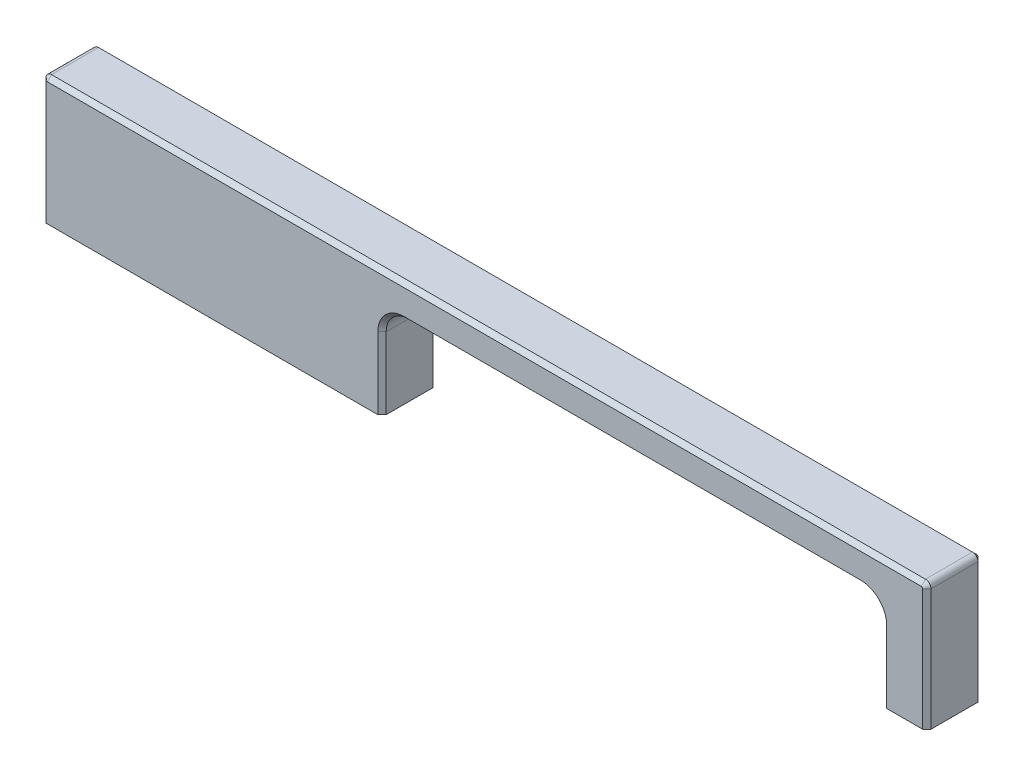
ISO-10303-21;
HEADER;
FILE_DESCRIPTION(('STEP AP214'),'2;1');
FILE_NAME('part.step','',(''),(''),'','','');
FILE_SCHEMA(('AUTOMOTIVE_DESIGN { 1 0 10303 214 1 1 1 1 }'));
ENDSEC;
DATA;
#1=APPLICATION_CONTEXT('core data for automotive mechanical design processes');
#2=APPLICATION_PROTOCOL_DEFINITION('international standard','automotive_design',2000,#1);
#3=PRODUCT_CONTEXT('',#1,'mechanical');
#4=PRODUCT('Part','Part','',(#3));
#5=PRODUCT_RELATED_PRODUCT_CATEGORY('part','',(#4));
#6=PRODUCT_DEFINITION_FORMATION('','',#4);
#7=PRODUCT_DEFINITION_CONTEXT('part definition',#1,'design');
#8=PRODUCT_DEFINITION('design','',#6,#7);
#9=PRODUCT_DEFINITION_SHAPE('','',#8);
#10=(LENGTH_UNIT() NAMED_UNIT(*) SI_UNIT(.MILLI.,.METRE.));
#11=(NAMED_UNIT(*) PLANE_ANGLE_UNIT() SI_UNIT($,.RADIAN.));
#12=(NAMED_UNIT(*) SI_UNIT($,.STERADIAN.) SOLID_ANGLE_UNIT());
#13=UNCERTAINTY_MEASURE_WITH_UNIT(LENGTH_MEASURE(1.E-05),#10,'distance_accuracy_value','');
#14=(GEOMETRIC_REPRESENTATION_CONTEXT(3) GLOBAL_UNCERTAINTY_ASSIGNED_CONTEXT((#13)) GLOBAL_UNIT_ASSIGNED_CONTEXT((#10,
#11,#12)) REPRESENTATION_CONTEXT('',''));
#15=CARTESIAN_POINT('',(0.,0.,0.));
#16=DIRECTION('',(0.,0.,1.));
#17=DIRECTION('',(1.,0.,0.));
#18=AXIS2_PLACEMENT_3D('',#15,#16,#17);
#19=CARTESIAN_POINT('',(80.,23.,5.));
#20=DIRECTION('',(-1.,0.,0.));
#21=DIRECTION('',(0.,-1.,0.));
#22=AXIS2_PLACEMENT_3D('',#19,#20,#21);
#23=PLANE('',#22);
#24=DIRECTION('',(0.,0.,-1.));
#25=VECTOR('',#24,1.);
#26=CARTESIAN_POINT('',(80.,0.,5.));
#27=LINE('',#26,#25);
#28=CARTESIAN_POINT('',(80.,0.,4.25));
#29=VERTEX_POINT('',#28);
#30=CARTESIAN_POINT('',(80.,0.,-4.25000000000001));
#31=VERTEX_POINT('',#30);
#32=EDGE_CURVE('E248',#29,#31,#27,.T.);
#33=ORIENTED_EDGE('',*,*,#32,.T.);
#34=DIRECTION('',(0.,1.,0.));
#35=VECTOR('',#34,1.);
#36=CARTESIAN_POINT('',(80.,22.,-4.25000000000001));
#37=LINE('',#36,#35);
#38=CARTESIAN_POINT('',(80.,22.,-4.25000000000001));
#39=VERTEX_POINT('',#38);
#40=EDGE_CURVE('E390',#31,#39,#37,.T.);
#41=ORIENTED_EDGE('',*,*,#40,.T.);
#42=DIRECTION('',(0.,0.,-1.));
#43=VECTOR('',#42,1.);
#44=CARTESIAN_POINT('',(80.,22.,5.));
#45=LINE('',#44,#43);
#46=CARTESIAN_POINT('',(80.,22.,4.25));
#47=VERTEX_POINT('',#46);
#48=EDGE_CURVE('E294',#39,#47,#45,.F.);
#49=ORIENTED_EDGE('',*,*,#48,.T.);
#50=DIRECTION('',(0.,-1.,0.));
#51=VECTOR('',#50,1.);
#52=CARTESIAN_POINT('',(80.,23.,4.25));
#53=LINE('',#52,#51);
#54=EDGE_CURVE('E387',#47,#29,#53,.T.);
#55=ORIENTED_EDGE('',*,*,#54,.T.);
#56=EDGE_LOOP('',(#33,#41,#49,#55));
#57=FACE_BOUND('',#56,.T.);
#58=ADVANCED_FACE('F45',(#57),#23,.F.);
#59=CARTESIAN_POINT('',(-80.,23.,5.));
#60=DIRECTION('',(0.,-1.,0.));
#61=DIRECTION('',(0.,0.,-1.));
#62=AXIS2_PLACEMENT_3D('',#59,#60,#61);
#63=PLANE('',#62);
#64=DIRECTION('',(0.,0.,-1.));
#65=VECTOR('',#64,1.);
#66=CARTESIAN_POINT('',(79.,23.,5.));
#67=LINE('',#66,#65);
#68=CARTESIAN_POINT('',(79.,23.,4.25));
#69=VERTEX_POINT('',#68);
#70=CARTESIAN_POINT('',(79.,23.,-4.25000000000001));
#71=VERTEX_POINT('',#70);
#72=EDGE_CURVE('E290',#69,#71,#67,.T.);
#73=ORIENTED_EDGE('',*,*,#72,.T.);
#74=DIRECTION('',(-1.,0.,0.));
#75=VECTOR('',#74,1.);
#76=CARTESIAN_POINT('',(-79.,23.,-4.25000000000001));
#77=LINE('',#76,#75);
#78=CARTESIAN_POINT('',(-79.,23.,-4.25000000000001));
#79=VERTEX_POINT('',#78);
#80=EDGE_CURVE('E403',#71,#79,#77,.T.);
#81=ORIENTED_EDGE('',*,*,#80,.T.);
#82=DIRECTION('',(0.,0.,-1.));
#83=VECTOR('',#82,1.);
#84=CARTESIAN_POINT('',(-79.,23.,5.));
#85=LINE('',#84,#83);
#86=CARTESIAN_POINT('',(-79.,23.,4.25));
#87=VERTEX_POINT('',#86);
#88=EDGE_CURVE('E286',#79,#87,#85,.F.);
#89=ORIENTED_EDGE('',*,*,#88,.T.);
#90=DIRECTION('',(1.,0.,0.));
#91=VECTOR('',#90,1.);
#92=CARTESIAN_POINT('',(-80.,23.,4.25));
#93=LINE('',#92,#91);
#94=EDGE_CURVE('E400',#87,#69,#93,.T.);
#95=ORIENTED_EDGE('',*,*,#94,.T.);
#96=EDGE_LOOP('',(#73,#81,#89,#95));
#97=FACE_BOUND('',#96,.T.);
#98=ADVANCED_FACE('F576',(#97),#63,.F.);
#99=CARTESIAN_POINT('',(-80.,0.,5.));
#100=DIRECTION('',(1.,0.,0.));
#101=DIRECTION('',(0.,1.,0.));
#102=AXIS2_PLACEMENT_3D('',#99,#100,#101);
#103=PLANE('',#102);
#104=DIRECTION('',(0.,0.,-1.));
#105=VECTOR('',#104,1.);
#106=CARTESIAN_POINT('',(-80.,22.,5.));
#107=LINE('',#106,#105);
#108=CARTESIAN_POINT('',(-80.,22.,4.25));
#109=VERTEX_POINT('',#108);
#110=CARTESIAN_POINT('',(-80.,22.,-4.25000000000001));
#111=VERTEX_POINT('',#110);
#112=EDGE_CURVE('E298',#109,#111,#107,.T.);
#113=ORIENTED_EDGE('',*,*,#112,.T.);
#114=DIRECTION('',(0.,-1.,0.));
#115=VECTOR('',#114,1.);
#116=CARTESIAN_POINT('',(-80.,0.,-4.25000000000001));
#117=LINE('',#116,#115);
#118=CARTESIAN_POINT('',(-80.,0.,-4.25000000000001));
#119=VERTEX_POINT('',#118);
#120=EDGE_CURVE('E415',#111,#119,#117,.T.);
#121=ORIENTED_EDGE('',*,*,#120,.T.);
#122=DIRECTION('',(0.,0.,-1.));
#123=VECTOR('',#122,1.);
#124=CARTESIAN_POINT('',(-80.,0.,5.));
#125=LINE('',#124,#123);
#126=CARTESIAN_POINT('',(-80.,0.,4.25));
#127=VERTEX_POINT('',#126);
#128=EDGE_CURVE('E266',#127,#119,#125,.T.);
#129=ORIENTED_EDGE('',*,*,#128,.F.);
#130=DIRECTION('',(0.,1.,0.));
#131=VECTOR('',#130,1.);
#132=CARTESIAN_POINT('',(-80.,0.,4.25));
#133=LINE('',#132,#131);
#134=EDGE_CURVE('E412',#127,#109,#133,.T.);
#135=ORIENTED_EDGE('',*,*,#134,.T.);
#136=EDGE_LOOP('',(#113,#121,#129,#135));
#137=FACE_BOUND('',#136,.T.);
#138=ADVANCED_FACE('F592',(#137),#103,.F.);
#139=CARTESIAN_POINT('',(-18.5,0.,5.));
#140=DIRECTION('',(0.,1.,0.));
#141=DIRECTION('',(-1.,0.,0.));
#142=AXIS2_PLACEMENT_3D('',#139,#140,#141);
#143=PLANE('',#142);
#144=CARTESIAN_POINT('',(-54.,0.,0.));
#145=DIRECTION('',(0.,-1.,0.));
#146=DIRECTION('',(0.,0.,-1.));
#147=AXIS2_PLACEMENT_3D('',#144,#145,#146);
#148=CIRCLE('',#147,1.64999999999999);
#149=CARTESIAN_POINT('',(-54.,0.,-1.65));
#150=VERTEX_POINT('',#149);
#151=EDGE_CURVE('E223',#150,#150,#148,.T.);
#152=ORIENTED_EDGE('',*,*,#151,.F.);
#153=EDGE_LOOP('',(#152));
#154=FACE_BOUND('',#153,.T.);
#155=DIRECTION('',(1.,0.,0.));
#156=VECTOR('',#155,1.);
#157=CARTESIAN_POINT('',(-18.5,0.,-5.));
#158=LINE('',#157,#156);
#159=CARTESIAN_POINT('',(-79.25,0.,-5.));
#160=VERTEX_POINT('',#159);
#161=CARTESIAN_POINT('',(-19.25,0.,-5.));
#162=VERTEX_POINT('',#161);
#163=EDGE_CURVE('E238',#160,#162,#158,.T.);
#164=ORIENTED_EDGE('',*,*,#163,.T.);
#165=DIRECTION('',(0.707106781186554,0.,0.707106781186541));
#166=VECTOR('',#165,1.);
#167=CARTESIAN_POINT('',(-18.5,0.,-4.25000000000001));
#168=LINE('',#167,#166);
#169=CARTESIAN_POINT('',(-18.5,0.,-4.25000000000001));
#170=VERTEX_POINT('',#169);
#171=EDGE_CURVE('E384',#162,#170,#168,.T.);
#172=ORIENTED_EDGE('',*,*,#171,.T.);
#173=DIRECTION('',(0.,0.,-1.));
#174=VECTOR('',#173,1.);
#175=CARTESIAN_POINT('',(-18.5,0.,5.));
#176=LINE('',#175,#174);
#177=CARTESIAN_POINT('',(-18.5,0.,4.25));
#178=VERTEX_POINT('',#177);
#179=EDGE_CURVE('E262',#178,#170,#176,.T.);
#180=ORIENTED_EDGE('',*,*,#179,.F.);
#181=DIRECTION('',(0.707106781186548,0.,-0.707106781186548));
#182=VECTOR('',#181,1.);
#183=CARTESIAN_POINT('',(-19.25,0.,5.));
#184=LINE('',#183,#182);
#185=CARTESIAN_POINT('',(-19.25,0.,5.));
#186=VERTEX_POINT('',#185);
#187=EDGE_CURVE('E378',#178,#186,#184,.F.);
#188=ORIENTED_EDGE('',*,*,#187,.T.);
#189=DIRECTION('',(1.,0.,0.));
#190=VECTOR('',#189,1.);
#191=CARTESIAN_POINT('',(-18.5,0.,5.));
#192=LINE('',#191,#190);
#193=CARTESIAN_POINT('',(-79.25,0.,5.));
#194=VERTEX_POINT('',#193);
#195=EDGE_CURVE('E239',#194,#186,#192,.T.);
#196=ORIENTED_EDGE('',*,*,#195,.F.);
#197=DIRECTION('',(0.707106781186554,0.,0.707106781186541));
#198=VECTOR('',#197,1.);
#199=CARTESIAN_POINT('',(-79.25,0.,5.));
#200=LINE('',#199,#198);
#201=EDGE_CURVE('E375',#194,#127,#200,.F.);
#202=ORIENTED_EDGE('',*,*,#201,.T.);
#203=ORIENTED_EDGE('',*,*,#128,.T.);
#204=DIRECTION('',(0.707106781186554,0.,-0.707106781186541));
#205=VECTOR('',#204,1.);
#206=CARTESIAN_POINT('',(-80.,0.,-4.25000000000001));
#207=LINE('',#206,#205);
#208=EDGE_CURVE('E381',#119,#160,#207,.T.);
#209=ORIENTED_EDGE('',*,*,#208,.T.);
#210=EDGE_LOOP('',(#164,#172,#180,#188,#196,#202,#203,#209));
#211=FACE_BOUND('',#210,.T.);
#212=ADVANCED_FACE('F518',(#154,#211),#143,.F.);
#213=CARTESIAN_POINT('',(-18.5,17.,5.));
#214=DIRECTION('',(-1.,0.,0.));
#215=DIRECTION('',(0.,-1.,0.));
#216=AXIS2_PLACEMENT_3D('',#213,#214,#215);
#217=PLANE('',#216);
#218=ORIENTED_EDGE('',*,*,#179,.T.);
#219=DIRECTION('',(0.,1.,0.));
#220=VECTOR('',#219,1.);
#221=CARTESIAN_POINT('',(-18.5,13.,-4.25000000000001));
#222=LINE('',#221,#220);
#223=CARTESIAN_POINT('',(-18.5,13.,-4.25000000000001));
#224=VERTEX_POINT('',#223);
#225=EDGE_CURVE('E372',#170,#224,#222,.T.);
#226=ORIENTED_EDGE('',*,*,#225,.T.);
#227=DIRECTION('',(0.,0.,-1.));
#228=VECTOR('',#227,1.);
#229=CARTESIAN_POINT('',(-18.5,13.,5.));
#230=LINE('',#229,#228);
#231=CARTESIAN_POINT('',(-18.5,13.,4.25));
#232=VERTEX_POINT('',#231);
#233=EDGE_CURVE('E282',#224,#232,#230,.F.);
#234=ORIENTED_EDGE('',*,*,#233,.T.);
#235=DIRECTION('',(0.,-1.,0.));
#236=VECTOR('',#235,1.);
#237=CARTESIAN_POINT('',(-18.5,17.,4.25));
#238=LINE('',#237,#236);
#239=EDGE_CURVE('E369',#232,#178,#238,.T.);
#240=ORIENTED_EDGE('',*,*,#239,.T.);
#241=EDGE_LOOP('',(#218,#226,#234,#240));
#242=FACE_BOUND('',#241,.T.);
#243=ADVANCED_FACE('F646',(#242),#217,.F.);
#244=CARTESIAN_POINT('',(72.,17.,5.));
#245=DIRECTION('',(0.,1.,0.));
#246=DIRECTION('',(-1.,0.,0.));
#247=AXIS2_PLACEMENT_3D('',#244,#245,#246);
#248=PLANE('',#247);
#249=DIRECTION('',(0.,0.,-1.));
#250=VECTOR('',#249,1.);
#251=CARTESIAN_POINT('',(-14.5,17.,-5.));
#252=LINE('',#251,#250);
#253=CARTESIAN_POINT('',(-14.5,17.,4.25));
#254=VERTEX_POINT('',#253);
#255=CARTESIAN_POINT('',(-14.5,17.,-4.25000000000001));
#256=VERTEX_POINT('',#255);
#257=EDGE_CURVE('E274',#254,#256,#252,.T.);
#258=ORIENTED_EDGE('',*,*,#257,.T.);
#259=DIRECTION('',(1.,0.,0.));
#260=VECTOR('',#259,1.);
#261=CARTESIAN_POINT('',(68.,17.,-4.25000000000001));
#262=LINE('',#261,#260);
#263=CARTESIAN_POINT('',(68.,17.,-4.25000000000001));
#264=VERTEX_POINT('',#263);
#265=EDGE_CURVE('E360',#256,#264,#262,.T.);
#266=ORIENTED_EDGE('',*,*,#265,.T.);
#267=DIRECTION('',(0.,0.,-1.));
#268=VECTOR('',#267,1.);
#269=CARTESIAN_POINT('',(68.,17.,5.));
#270=LINE('',#269,#268);
#271=CARTESIAN_POINT('',(68.,17.,4.25));
#272=VERTEX_POINT('',#271);
#273=EDGE_CURVE('E278',#264,#272,#270,.F.);
#274=ORIENTED_EDGE('',*,*,#273,.T.);
#275=DIRECTION('',(-1.,0.,0.));
#276=VECTOR('',#275,1.);
#277=CARTESIAN_POINT('',(72.,17.,4.25));
#278=LINE('',#277,#276);
#279=EDGE_CURVE('E357',#272,#254,#278,.T.);
#280=ORIENTED_EDGE('',*,*,#279,.T.);
#281=EDGE_LOOP('',(#258,#266,#274,#280));
#282=FACE_BOUND('',#281,.T.);
#283=ADVANCED_FACE('F618',(#282),#248,.F.);
#284=CARTESIAN_POINT('',(72.,0.,5.));
#285=DIRECTION('',(1.,0.,0.));
#286=DIRECTION('',(0.,0.,-1.));
#287=AXIS2_PLACEMENT_3D('',#284,#285,#286);
#288=PLANE('',#287);
#289=DIRECTION('',(0.,0.,-1.));
#290=VECTOR('',#289,1.);
#291=CARTESIAN_POINT('',(72.,13.,-5.));
#292=LINE('',#291,#290);
#293=CARTESIAN_POINT('',(72.,13.,4.25));
#294=VERTEX_POINT('',#293);
#295=CARTESIAN_POINT('',(72.,13.,-4.25000000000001));
#296=VERTEX_POINT('',#295);
#297=EDGE_CURVE('E270',#294,#296,#292,.T.);
#298=ORIENTED_EDGE('',*,*,#297,.T.);
#299=DIRECTION('',(0.,-1.,0.));
#300=VECTOR('',#299,1.);
#301=CARTESIAN_POINT('',(72.,0.,-4.25000000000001));
#302=LINE('',#301,#300);
#303=CARTESIAN_POINT('',(72.,0.,-4.25000000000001));
#304=VERTEX_POINT('',#303);
#305=EDGE_CURVE('E305',#296,#304,#302,.T.);
#306=ORIENTED_EDGE('',*,*,#305,.T.);
#307=DIRECTION('',(0.,0.,-1.));
#308=VECTOR('',#307,1.);
#309=CARTESIAN_POINT('',(72.,0.,5.));
#310=LINE('',#309,#308);
#311=CARTESIAN_POINT('',(72.,0.,4.25));
#312=VERTEX_POINT('',#311);
#313=EDGE_CURVE('E258',#312,#304,#310,.T.);
#314=ORIENTED_EDGE('',*,*,#313,.F.);
#315=DIRECTION('',(0.,1.,0.));
#316=VECTOR('',#315,1.);
#317=CARTESIAN_POINT('',(72.,0.,4.25));
#318=LINE('',#317,#316);
#319=EDGE_CURVE('E302',#312,#294,#318,.T.);
#320=ORIENTED_EDGE('',*,*,#319,.T.);
#321=EDGE_LOOP('',(#298,#306,#314,#320));
#322=FACE_BOUND('',#321,.T.);
#323=ADVANCED_FACE('F637',(#322),#288,.F.);
#324=CARTESIAN_POINT('',(80.,0.,5.));
#325=DIRECTION('',(0.,1.,0.));
#326=DIRECTION('',(-1.,0.,0.));
#327=AXIS2_PLACEMENT_3D('',#324,#325,#326);
#328=PLANE('',#327);
#329=CARTESIAN_POINT('',(76.,0.,0.));
#330=DIRECTION('',(0.,-1.,0.));
#331=DIRECTION('',(0.,0.,-1.));
#332=AXIS2_PLACEMENT_3D('',#329,#330,#331);
#333=CIRCLE('',#332,1.64999999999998);
#334=CARTESIAN_POINT('',(76.,0.,-1.64999999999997));
#335=VERTEX_POINT('',#334);
#336=EDGE_CURVE('E224',#335,#335,#333,.T.);
#337=ORIENTED_EDGE('',*,*,#336,.F.);
#338=EDGE_LOOP('',(#337));
#339=FACE_BOUND('',#338,.T.);
#340=ORIENTED_EDGE('',*,*,#313,.T.);
#341=DIRECTION('',(0.707106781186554,0.,-0.707106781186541));
#342=VECTOR('',#341,1.);
#343=CARTESIAN_POINT('',(72.,0.,-4.25000000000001));
#344=LINE('',#343,#342);
#345=CARTESIAN_POINT('',(72.75,0.,-5.));
#346=VERTEX_POINT('',#345);
#347=EDGE_CURVE('E318',#304,#346,#344,.T.);
#348=ORIENTED_EDGE('',*,*,#347,.T.);
#349=DIRECTION('',(1.,0.,0.));
#350=VECTOR('',#349,1.);
#351=CARTESIAN_POINT('',(80.,0.,-5.));
#352=LINE('',#351,#350);
#353=CARTESIAN_POINT('',(79.25,0.,-5.));
#354=VERTEX_POINT('',#353);
#355=EDGE_CURVE('E244',#346,#354,#352,.T.);
#356=ORIENTED_EDGE('',*,*,#355,.T.);
#357=DIRECTION('',(0.707106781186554,0.,0.707106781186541));
#358=VECTOR('',#357,1.);
#359=CARTESIAN_POINT('',(80.,0.,-4.25000000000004));
#360=LINE('',#359,#358);
#361=EDGE_CURVE('E315',#354,#31,#360,.T.);
#362=ORIENTED_EDGE('',*,*,#361,.T.);
#363=ORIENTED_EDGE('',*,*,#32,.F.);
#364=DIRECTION('',(0.707106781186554,0.,-0.707106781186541));
#365=VECTOR('',#364,1.);
#366=CARTESIAN_POINT('',(79.25,0.,5.));
#367=LINE('',#366,#365);
#368=CARTESIAN_POINT('',(79.25,0.,5.));
#369=VERTEX_POINT('',#368);
#370=EDGE_CURVE('E309',#29,#369,#367,.F.);
#371=ORIENTED_EDGE('',*,*,#370,.T.);
#372=DIRECTION('',(1.,0.,0.));
#373=VECTOR('',#372,1.);
#374=CARTESIAN_POINT('',(80.,0.,5.));
#375=LINE('',#374,#373);
#376=CARTESIAN_POINT('',(72.75,0.,5.));
#377=VERTEX_POINT('',#376);
#378=EDGE_CURVE('E243',#377,#369,#375,.T.);
#379=ORIENTED_EDGE('',*,*,#378,.F.);
#380=DIRECTION('',(0.707106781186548,0.,0.707106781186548));
#381=VECTOR('',#380,1.);
#382=CARTESIAN_POINT('',(72.75,0.,5.));
#383=LINE('',#382,#381);
#384=EDGE_CURVE('E312',#377,#312,#383,.F.);
#385=ORIENTED_EDGE('',*,*,#384,.T.);
#386=EDGE_LOOP('',(#340,#348,#356,#362,#363,#371,#379,#385));
#387=FACE_BOUND('',#386,.T.);
#388=ADVANCED_FACE('F544',(#339,#387),#328,.F.);
#389=CARTESIAN_POINT('',(0.,0.,5.));
#390=DIRECTION('',(0.,0.,-1.));
#391=DIRECTION('',(-1.,0.,0.));
#392=AXIS2_PLACEMENT_3D('',#389,#390,#391);
#393=PLANE('',#392);
#394=CARTESIAN_POINT('',(68.,13.,5.));
#395=DIRECTION('',(0.,0.,-1.));
#396=DIRECTION('',(-1.,0.,0.));
#397=AXIS2_PLACEMENT_3D('',#394,#395,#396);
#398=CIRCLE('',#397,4.75);
#399=CARTESIAN_POINT('',(68.,17.75,5.));
#400=VERTEX_POINT('',#399);
#401=CARTESIAN_POINT('',(72.75,13.,5.));
#402=VERTEX_POINT('',#401);
#403=EDGE_CURVE('E56',#400,#402,#398,.T.);
#404=ORIENTED_EDGE('',*,*,#403,.T.);
#405=DIRECTION('',(0.,-1.,0.));
#406=VECTOR('',#405,1.);
#407=CARTESIAN_POINT('',(72.75,0.,5.));
#408=LINE('',#407,#406);
#409=EDGE_CURVE('E11',#402,#377,#408,.T.);
#410=ORIENTED_EDGE('',*,*,#409,.T.);
#411=ORIENTED_EDGE('',*,*,#378,.T.);
#412=DIRECTION('',(0.,1.,0.));
#413=VECTOR('',#412,1.);
#414=CARTESIAN_POINT('',(79.25,0.,5.));
#415=LINE('',#414,#413);
#416=CARTESIAN_POINT('',(79.25,22.,5.));
#417=VERTEX_POINT('',#416);
#418=EDGE_CURVE('E430',#369,#417,#415,.T.);
#419=ORIENTED_EDGE('',*,*,#418,.T.);
#420=CARTESIAN_POINT('',(79.,22.,5.));
#421=DIRECTION('',(0.,0.,-1.));
#422=DIRECTION('',(-1.,0.,0.));
#423=AXIS2_PLACEMENT_3D('',#420,#421,#422);
#424=CIRCLE('',#423,0.249999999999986);
#425=CARTESIAN_POINT('',(79.,22.25,5.));
#426=VERTEX_POINT('',#425);
#427=EDGE_CURVE('E427',#417,#426,#424,.F.);
#428=ORIENTED_EDGE('',*,*,#427,.T.);
#429=DIRECTION('',(-1.,0.,0.));
#430=VECTOR('',#429,1.);
#431=CARTESIAN_POINT('',(0.,22.25,5.));
#432=LINE('',#431,#430);
#433=CARTESIAN_POINT('',(-79.,22.25,5.));
#434=VERTEX_POINT('',#433);
#435=EDGE_CURVE('E424',#426,#434,#432,.T.);
#436=ORIENTED_EDGE('',*,*,#435,.T.);
#437=CARTESIAN_POINT('',(-79.,22.,5.));
#438=DIRECTION('',(0.,0.,-1.));
#439=DIRECTION('',(-1.,0.,0.));
#440=AXIS2_PLACEMENT_3D('',#437,#438,#439);
#441=CIRCLE('',#440,0.249999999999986);
#442=CARTESIAN_POINT('',(-79.25,22.,5.));
#443=VERTEX_POINT('',#442);
#444=EDGE_CURVE('E421',#434,#443,#441,.F.);
#445=ORIENTED_EDGE('',*,*,#444,.T.);
#446=DIRECTION('',(0.,-1.,0.));
#447=VECTOR('',#446,1.);
#448=CARTESIAN_POINT('',(-79.25,0.,5.));
#449=LINE('',#448,#447);
#450=EDGE_CURVE('E418',#443,#194,#449,.T.);
#451=ORIENTED_EDGE('',*,*,#450,.T.);
#452=ORIENTED_EDGE('',*,*,#195,.T.);
#453=DIRECTION('',(0.,1.,0.));
#454=VECTOR('',#453,1.);
#455=CARTESIAN_POINT('',(-19.25,0.,5.));
#456=LINE('',#455,#454);
#457=CARTESIAN_POINT('',(-19.25,13.,5.));
#458=VERTEX_POINT('',#457);
#459=EDGE_CURVE('E434',#186,#458,#456,.T.);
#460=ORIENTED_EDGE('',*,*,#459,.T.);
#461=CARTESIAN_POINT('',(-14.5,13.,5.));
#462=DIRECTION('',(0.,0.,-1.));
#463=DIRECTION('',(-1.,0.,0.));
#464=AXIS2_PLACEMENT_3D('',#461,#462,#463);
#465=CIRCLE('',#464,4.75);
#466=CARTESIAN_POINT('',(-14.5,17.75,5.));
#467=VERTEX_POINT('',#466);
#468=EDGE_CURVE('E437',#458,#467,#465,.T.);
#469=ORIENTED_EDGE('',*,*,#468,.T.);
#470=DIRECTION('',(1.,0.,0.));
#471=VECTOR('',#470,1.);
#472=CARTESIAN_POINT('',(0.,17.75,5.));
#473=LINE('',#472,#471);
#474=EDGE_CURVE('E67',#467,#400,#473,.T.);
#475=ORIENTED_EDGE('',*,*,#474,.T.);
#476=EDGE_LOOP('',(#404,#410,#411,#419,#428,#436,#445,#451,#452,#460,#469,#475));
#477=FACE_BOUND('',#476,.T.);
#478=ADVANCED_FACE('F515',(#477),#393,.F.);
#479=CARTESIAN_POINT('',(0.,0.,-5.));
#480=DIRECTION('',(0.,0.,-1.));
#481=DIRECTION('',(-1.,0.,0.));
#482=AXIS2_PLACEMENT_3D('',#479,#480,#481);
#483=PLANE('',#482);
#484=ORIENTED_EDGE('',*,*,#355,.F.);
#485=DIRECTION('',(0.,1.,0.));
#486=VECTOR('',#485,1.);
#487=CARTESIAN_POINT('',(72.75,13.,-5.));
#488=LINE('',#487,#486);
#489=CARTESIAN_POINT('',(72.75,13.,-5.));
#490=VERTEX_POINT('',#489);
#491=EDGE_CURVE('E348',#346,#490,#488,.T.);
#492=ORIENTED_EDGE('',*,*,#491,.T.);
#493=CARTESIAN_POINT('',(68.,13.,-5.));
#494=DIRECTION('',(0.,0.,-1.));
#495=DIRECTION('',(-1.,0.,0.));
#496=AXIS2_PLACEMENT_3D('',#493,#494,#495);
#497=CIRCLE('',#496,4.75);
#498=CARTESIAN_POINT('',(68.,17.75,-5.));
#499=VERTEX_POINT('',#498);
#500=EDGE_CURVE('E345',#490,#499,#497,.F.);
#501=ORIENTED_EDGE('',*,*,#500,.T.);
#502=DIRECTION('',(-1.,0.,0.));
#503=VECTOR('',#502,1.);
#504=CARTESIAN_POINT('',(-14.5,17.75,-5.));
#505=LINE('',#504,#503);
#506=CARTESIAN_POINT('',(-14.5,17.75,-5.));
#507=VERTEX_POINT('',#506);
#508=EDGE_CURVE('E342',#499,#507,#505,.T.);
#509=ORIENTED_EDGE('',*,*,#508,.T.);
#510=CARTESIAN_POINT('',(-14.5,13.,-5.));
#511=DIRECTION('',(0.,0.,-1.));
#512=DIRECTION('',(-1.,0.,0.));
#513=AXIS2_PLACEMENT_3D('',#510,#511,#512);
#514=CIRCLE('',#513,4.75);
#515=CARTESIAN_POINT('',(-19.25,13.,-5.));
#516=VERTEX_POINT('',#515);
#517=EDGE_CURVE('E339',#507,#516,#514,.F.);
#518=ORIENTED_EDGE('',*,*,#517,.T.);
#519=DIRECTION('',(0.,-1.,0.));
#520=VECTOR('',#519,1.);
#521=CARTESIAN_POINT('',(-19.25,0.,-5.));
#522=LINE('',#521,#520);
#523=EDGE_CURVE('E336',#516,#162,#522,.T.);
#524=ORIENTED_EDGE('',*,*,#523,.T.);
#525=ORIENTED_EDGE('',*,*,#163,.F.);
#526=DIRECTION('',(0.,1.,0.));
#527=VECTOR('',#526,1.);
#528=CARTESIAN_POINT('',(-79.25,22.,-5.));
#529=LINE('',#528,#527);
#530=CARTESIAN_POINT('',(-79.25,22.,-5.));
#531=VERTEX_POINT('',#530);
#532=EDGE_CURVE('E321',#160,#531,#529,.T.);
#533=ORIENTED_EDGE('',*,*,#532,.T.);
#534=CARTESIAN_POINT('',(-79.,22.,-5.));
#535=DIRECTION('',(0.,0.,-1.));
#536=DIRECTION('',(-1.,0.,0.));
#537=AXIS2_PLACEMENT_3D('',#534,#535,#536);
#538=CIRCLE('',#537,0.25);
#539=CARTESIAN_POINT('',(-79.,22.25,-5.));
#540=VERTEX_POINT('',#539);
#541=EDGE_CURVE('E324',#531,#540,#538,.T.);
#542=ORIENTED_EDGE('',*,*,#541,.T.);
#543=DIRECTION('',(1.,0.,0.));
#544=VECTOR('',#543,1.);
#545=CARTESIAN_POINT('',(79.,22.25,-5.));
#546=LINE('',#545,#544);
#547=CARTESIAN_POINT('',(79.,22.25,-5.));
#548=VERTEX_POINT('',#547);
#549=EDGE_CURVE('E327',#540,#548,#546,.T.);
#550=ORIENTED_EDGE('',*,*,#549,.T.);
#551=CARTESIAN_POINT('',(79.,22.,-5.));
#552=DIRECTION('',(0.,0.,-1.));
#553=DIRECTION('',(-1.,0.,0.));
#554=AXIS2_PLACEMENT_3D('',#551,#552,#553);
#555=CIRCLE('',#554,0.25);
#556=CARTESIAN_POINT('',(79.25,22.,-5.));
#557=VERTEX_POINT('',#556);
#558=EDGE_CURVE('E330',#548,#557,#555,.T.);
#559=ORIENTED_EDGE('',*,*,#558,.T.);
#560=DIRECTION('',(0.,-1.,0.));
#561=VECTOR('',#560,1.);
#562=CARTESIAN_POINT('',(79.25,0.,-5.));
#563=LINE('',#562,#561);
#564=EDGE_CURVE('E333',#557,#354,#563,.T.);
#565=ORIENTED_EDGE('',*,*,#564,.T.);
#566=EDGE_LOOP('',(#484,#492,#501,#509,#518,#524,#525,#533,#542,#550,#559,#565));
#567=FACE_BOUND('',#566,.T.);
#568=ADVANCED_FACE('F601',(#567),#483,.T.);
#569=CARTESIAN_POINT('',(-54.,11.5,0.));
#570=DIRECTION('',(0.,-1.,0.));
#571=DIRECTION('',(0.,0.,-1.));
#572=AXIS2_PLACEMENT_3D('',#569,#570,#571);
#573=CONICAL_SURFACE('',#572,1.65,1.02974425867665);
#574=CARTESIAN_POINT('',(-54.,12.4914200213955,0.));
#575=VERTEX_POINT('',#574);
#576=VERTEX_LOOP('',#575);
#577=FACE_BOUND('',#576,.T.);
#578=CARTESIAN_POINT('',(-54.,11.5,0.));
#579=DIRECTION('',(0.,-1.,0.));
#580=DIRECTION('',(0.,0.,-1.));
#581=AXIS2_PLACEMENT_3D('',#578,#579,#580);
#582=CIRCLE('',#581,1.65);
#583=CARTESIAN_POINT('',(-54.,11.5,-1.65000000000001));
#584=VERTEX_POINT('',#583);
#585=EDGE_CURVE('E229',#584,#584,#582,.T.);
#586=ORIENTED_EDGE('',*,*,#585,.T.);
#587=EDGE_LOOP('',(#586));
#588=FACE_BOUND('',#587,.T.);
#589=ADVANCED_FACE('F857',(#577,#588),#573,.F.);
#590=CARTESIAN_POINT('',(-54.,0.,0.));
#591=DIRECTION('',(0.,-1.,0.));
#592=DIRECTION('',(0.,0.,-1.));
#593=AXIS2_PLACEMENT_3D('',#590,#591,#592);
#594=CYLINDRICAL_SURFACE('',#593,1.65);
#595=ORIENTED_EDGE('',*,*,#585,.F.);
#596=EDGE_LOOP('',(#595));
#597=FACE_BOUND('',#596,.T.);
#598=ORIENTED_EDGE('',*,*,#151,.T.);
#599=EDGE_LOOP('',(#598));
#600=FACE_BOUND('',#599,.T.);
#601=ADVANCED_FACE('F216',(#597,#600),#594,.F.);
#602=CARTESIAN_POINT('',(76.,11.5,0.));
#603=DIRECTION('',(0.,-1.,0.));
#604=DIRECTION('',(0.,0.,-1.));
#605=AXIS2_PLACEMENT_3D('',#602,#603,#604);
#606=CONICAL_SURFACE('',#605,1.65,1.02974425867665);
#607=CARTESIAN_POINT('',(76.,12.4914200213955,0.));
#608=VERTEX_POINT('',#607);
#609=VERTEX_LOOP('',#608);
#610=FACE_BOUND('',#609,.T.);
#611=CARTESIAN_POINT('',(76.,11.5,0.));
#612=DIRECTION('',(0.,-1.,0.));
#613=DIRECTION('',(0.,0.,-1.));
#614=AXIS2_PLACEMENT_3D('',#611,#612,#613);
#615=CIRCLE('',#614,1.65);
#616=CARTESIAN_POINT('',(76.,11.5,-1.64999999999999));
#617=VERTEX_POINT('',#616);
#618=EDGE_CURVE('E220',#617,#617,#615,.T.);
#619=ORIENTED_EDGE('',*,*,#618,.T.);
#620=EDGE_LOOP('',(#619));
#621=FACE_BOUND('',#620,.T.);
#622=ADVANCED_FACE('F212',(#610,#621),#606,.F.);
#623=CARTESIAN_POINT('',(76.,0.,0.));
#624=DIRECTION('',(0.,-1.,0.));
#625=DIRECTION('',(0.,0.,-1.));
#626=AXIS2_PLACEMENT_3D('',#623,#624,#625);
#627=CYLINDRICAL_SURFACE('',#626,1.64999999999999);
#628=ORIENTED_EDGE('',*,*,#618,.F.);
#629=EDGE_LOOP('',(#628));
#630=FACE_BOUND('',#629,.T.);
#631=ORIENTED_EDGE('',*,*,#336,.T.);
#632=EDGE_LOOP('',(#631));
#633=FACE_BOUND('',#632,.T.);
#634=ADVANCED_FACE('F215',(#630,#633),#627,.F.);
#635=CARTESIAN_POINT('',(68.,13.,5.));
#636=DIRECTION('',(0.,0.,1.));
#637=DIRECTION('',(1.,0.,0.));
#638=AXIS2_PLACEMENT_3D('',#635,#636,#637);
#639=CYLINDRICAL_SURFACE('',#638,4.);
#640=ORIENTED_EDGE('',*,*,#273,.F.);
#641=CARTESIAN_POINT('',(68.,13.,-4.25000000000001));
#642=DIRECTION('',(0.,0.,-1.));
#643=DIRECTION('',(-1.,0.,0.));
#644=AXIS2_PLACEMENT_3D('',#641,#642,#643);
#645=CIRCLE('',#644,4.);
#646=EDGE_CURVE('E354',#264,#296,#645,.T.);
#647=ORIENTED_EDGE('',*,*,#646,.T.);
#648=ORIENTED_EDGE('',*,*,#297,.F.);
#649=CARTESIAN_POINT('',(68.,13.,4.25));
#650=DIRECTION('',(0.,0.,-1.));
#651=DIRECTION('',(-1.,0.,0.));
#652=AXIS2_PLACEMENT_3D('',#649,#650,#651);
#653=CIRCLE('',#652,4.);
#654=EDGE_CURVE('E351',#294,#272,#653,.F.);
#655=ORIENTED_EDGE('',*,*,#654,.T.);
#656=EDGE_LOOP('',(#640,#647,#648,#655));
#657=FACE_BOUND('',#656,.T.);
#658=ADVANCED_FACE('F622',(#657),#639,.F.);
#659=CARTESIAN_POINT('',(-14.5,13.,5.));
#660=DIRECTION('',(0.,0.,1.));
#661=DIRECTION('',(1.,0.,0.));
#662=AXIS2_PLACEMENT_3D('',#659,#660,#661);
#663=CYLINDRICAL_SURFACE('',#662,4.);
#664=ORIENTED_EDGE('',*,*,#233,.F.);
#665=CARTESIAN_POINT('',(-14.5,13.,-4.25000000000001));
#666=DIRECTION('',(0.,0.,-1.));
#667=DIRECTION('',(-1.,0.,0.));
#668=AXIS2_PLACEMENT_3D('',#665,#666,#667);
#669=CIRCLE('',#668,4.);
#670=EDGE_CURVE('E366',#224,#256,#669,.T.);
#671=ORIENTED_EDGE('',*,*,#670,.T.);
#672=ORIENTED_EDGE('',*,*,#257,.F.);
#673=CARTESIAN_POINT('',(-14.5,13.,4.25));
#674=DIRECTION('',(0.,0.,-1.));
#675=DIRECTION('',(-1.,0.,0.));
#676=AXIS2_PLACEMENT_3D('',#673,#674,#675);
#677=CIRCLE('',#676,4.);
#678=EDGE_CURVE('E363',#254,#232,#677,.F.);
#679=ORIENTED_EDGE('',*,*,#678,.T.);
#680=EDGE_LOOP('',(#664,#671,#672,#679));
#681=FACE_BOUND('',#680,.T.);
#682=ADVANCED_FACE('F616',(#681),#663,.F.);
#683=CARTESIAN_POINT('',(79.,22.,5.));
#684=DIRECTION('',(0.,0.,-1.));
#685=DIRECTION('',(-1.,0.,0.));
#686=AXIS2_PLACEMENT_3D('',#683,#684,#685);
#687=CYLINDRICAL_SURFACE('',#686,1.);
#688=ORIENTED_EDGE('',*,*,#48,.F.);
#689=CARTESIAN_POINT('',(79.,22.,-4.25000000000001));
#690=DIRECTION('',(0.,0.,-1.));
#691=DIRECTION('',(-1.,0.,0.));
#692=AXIS2_PLACEMENT_3D('',#689,#690,#691);
#693=CIRCLE('',#692,1.);
#694=EDGE_CURVE('E397',#39,#71,#693,.F.);
#695=ORIENTED_EDGE('',*,*,#694,.T.);
#696=ORIENTED_EDGE('',*,*,#72,.F.);
#697=CARTESIAN_POINT('',(79.,22.,4.25));
#698=DIRECTION('',(0.,0.,-1.));
#699=DIRECTION('',(-1.,0.,0.));
#700=AXIS2_PLACEMENT_3D('',#697,#698,#699);
#701=CIRCLE('',#700,1.);
#702=EDGE_CURVE('E394',#69,#47,#701,.T.);
#703=ORIENTED_EDGE('',*,*,#702,.T.);
#704=EDGE_LOOP('',(#688,#695,#696,#703));
#705=FACE_BOUND('',#704,.T.);
#706=ADVANCED_FACE('F561',(#705),#687,.T.);
#707=CARTESIAN_POINT('',(-79.,22.,5.));
#708=DIRECTION('',(0.,0.,-1.));
#709=DIRECTION('',(-1.,0.,0.));
#710=AXIS2_PLACEMENT_3D('',#707,#708,#709);
#711=CYLINDRICAL_SURFACE('',#710,1.);
#712=ORIENTED_EDGE('',*,*,#88,.F.);
#713=CARTESIAN_POINT('',(-79.,22.,-4.25000000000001));
#714=DIRECTION('',(0.,0.,-1.));
#715=DIRECTION('',(-1.,0.,0.));
#716=AXIS2_PLACEMENT_3D('',#713,#714,#715);
#717=CIRCLE('',#716,1.);
#718=EDGE_CURVE('E409',#79,#111,#717,.F.);
#719=ORIENTED_EDGE('',*,*,#718,.T.);
#720=ORIENTED_EDGE('',*,*,#112,.F.);
#721=CARTESIAN_POINT('',(-79.,22.,4.25));
#722=DIRECTION('',(0.,0.,-1.));
#723=DIRECTION('',(-1.,0.,0.));
#724=AXIS2_PLACEMENT_3D('',#721,#722,#723);
#725=CIRCLE('',#724,1.);
#726=EDGE_CURVE('E406',#109,#87,#725,.T.);
#727=ORIENTED_EDGE('',*,*,#726,.T.);
#728=EDGE_LOOP('',(#712,#719,#720,#727));
#729=FACE_BOUND('',#728,.T.);
#730=ADVANCED_FACE('F589',(#729),#711,.T.);
#731=CARTESIAN_POINT('',(-18.5,17.,-4.25000000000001));
#732=DIRECTION('',(0.707106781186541,0.,-0.707106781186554));
#733=DIRECTION('',(0.,-1.,0.));
#734=AXIS2_PLACEMENT_3D('',#731,#732,#733);
#735=PLANE('',#734);
#736=ORIENTED_EDGE('',*,*,#171,.F.);
#737=ORIENTED_EDGE('',*,*,#523,.F.);
#738=DIRECTION('',(-0.707106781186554,0.,-0.707106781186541));
#739=VECTOR('',#738,1.);
#740=CARTESIAN_POINT('',(-18.5,13.,-4.25000000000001));
#741=LINE('',#740,#739);
#742=EDGE_CURVE('E232',#224,#516,#741,.T.);
#743=ORIENTED_EDGE('',*,*,#742,.F.);
#744=ORIENTED_EDGE('',*,*,#225,.F.);
#745=EDGE_LOOP('',(#736,#737,#743,#744));
#746=FACE_BOUND('',#745,.T.);
#747=ADVANCED_FACE('F606',(#746),#735,.T.);
#748=CARTESIAN_POINT('',(-14.5,13.,-5.));
#749=DIRECTION('',(0.,0.,-1.));
#750=DIRECTION('',(-1.,0.,0.));
#751=AXIS2_PLACEMENT_3D('',#748,#749,#750);
#752=CONICAL_SURFACE('',#751,4.75,0.785398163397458);
#753=ORIENTED_EDGE('',*,*,#742,.T.);
#754=ORIENTED_EDGE('',*,*,#517,.F.);
#755=DIRECTION('',(0.,0.707106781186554,-0.707106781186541));
#756=VECTOR('',#755,1.);
#757=CARTESIAN_POINT('',(-14.5,17.,-4.25000000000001));
#758=LINE('',#757,#756);
#759=EDGE_CURVE('E453',#256,#507,#758,.T.);
#760=ORIENTED_EDGE('',*,*,#759,.F.);
#761=ORIENTED_EDGE('',*,*,#670,.F.);
#762=EDGE_LOOP('',(#753,#754,#760,#761));
#763=FACE_BOUND('',#762,.T.);
#764=ADVANCED_FACE('F610',(#763),#752,.F.);
#765=CARTESIAN_POINT('',(72.,17.,-4.25000000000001));
#766=DIRECTION('',(0.,-0.707106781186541,-0.707106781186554));
#767=DIRECTION('',(-1.,0.,0.));
#768=AXIS2_PLACEMENT_3D('',#765,#766,#767);
#769=PLANE('',#768);
#770=ORIENTED_EDGE('',*,*,#759,.T.);
#771=ORIENTED_EDGE('',*,*,#508,.F.);
#772=DIRECTION('',(0.,0.707106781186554,-0.707106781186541));
#773=VECTOR('',#772,1.);
#774=CARTESIAN_POINT('',(68.,17.,-4.25000000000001));
#775=LINE('',#774,#773);
#776=EDGE_CURVE('E448',#264,#499,#775,.T.);
#777=ORIENTED_EDGE('',*,*,#776,.F.);
#778=ORIENTED_EDGE('',*,*,#265,.F.);
#779=EDGE_LOOP('',(#770,#771,#777,#778));
#780=FACE_BOUND('',#779,.T.);
#781=ADVANCED_FACE('F627',(#780),#769,.T.);
#782=CARTESIAN_POINT('',(68.,13.,-5.));
#783=DIRECTION('',(0.,0.,-1.));
#784=DIRECTION('',(-1.,0.,0.));
#785=AXIS2_PLACEMENT_3D('',#782,#783,#784);
#786=CONICAL_SURFACE('',#785,4.75,0.785398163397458);
#787=ORIENTED_EDGE('',*,*,#776,.T.);
#788=ORIENTED_EDGE('',*,*,#500,.F.);
#789=DIRECTION('',(0.707106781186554,0.,-0.707106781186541));
#790=VECTOR('',#789,1.);
#791=CARTESIAN_POINT('',(72.,13.,-4.25000000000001));
#792=LINE('',#791,#790);
#793=EDGE_CURVE('E444',#296,#490,#792,.T.);
#794=ORIENTED_EDGE('',*,*,#793,.F.);
#795=ORIENTED_EDGE('',*,*,#646,.F.);
#796=EDGE_LOOP('',(#787,#788,#794,#795));
#797=FACE_BOUND('',#796,.T.);
#798=ADVANCED_FACE('F631',(#797),#786,.F.);
#799=CARTESIAN_POINT('',(72.,0.,-4.25000000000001));
#800=DIRECTION('',(-0.707106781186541,0.,-0.707106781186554));
#801=DIRECTION('',(0.,1.,0.));
#802=AXIS2_PLACEMENT_3D('',#799,#800,#801);
#803=PLANE('',#802);
#804=ORIENTED_EDGE('',*,*,#793,.T.);
#805=ORIENTED_EDGE('',*,*,#491,.F.);
#806=ORIENTED_EDGE('',*,*,#347,.F.);
#807=ORIENTED_EDGE('',*,*,#305,.F.);
#808=EDGE_LOOP('',(#804,#805,#806,#807));
#809=FACE_BOUND('',#808,.T.);
#810=ADVANCED_FACE('F635',(#809),#803,.T.);
#811=CARTESIAN_POINT('',(-80.,0.,-4.25000000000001));
#812=DIRECTION('',(-0.707106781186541,0.,-0.707106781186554));
#813=DIRECTION('',(0.,1.,0.));
#814=AXIS2_PLACEMENT_3D('',#811,#812,#813);
#815=PLANE('',#814);
#816=ORIENTED_EDGE('',*,*,#208,.F.);
#817=ORIENTED_EDGE('',*,*,#120,.F.);
#818=DIRECTION('',(-0.707106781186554,0.,0.707106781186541));
#819=VECTOR('',#818,1.);
#820=CARTESIAN_POINT('',(-79.25,22.,-5.));
#821=LINE('',#820,#819);
#822=EDGE_CURVE('E449',#531,#111,#821,.T.);
#823=ORIENTED_EDGE('',*,*,#822,.F.);
#824=ORIENTED_EDGE('',*,*,#532,.F.);
#825=EDGE_LOOP('',(#816,#817,#823,#824));
#826=FACE_BOUND('',#825,.T.);
#827=ADVANCED_FACE('F595',(#826),#815,.T.);
#828=CARTESIAN_POINT('',(-79.,22.,-5.));
#829=DIRECTION('',(0.,0.,1.));
#830=DIRECTION('',(1.,0.,0.));
#831=AXIS2_PLACEMENT_3D('',#828,#829,#830);
#832=CONICAL_SURFACE('',#831,0.25,0.785398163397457);
#833=ORIENTED_EDGE('',*,*,#822,.T.);
#834=ORIENTED_EDGE('',*,*,#718,.F.);
#835=DIRECTION('',(0.,0.707106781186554,0.707106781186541));
#836=VECTOR('',#835,1.);
#837=CARTESIAN_POINT('',(-79.,22.25,-5.));
#838=LINE('',#837,#836);
#839=EDGE_CURVE('E468',#540,#79,#838,.T.);
#840=ORIENTED_EDGE('',*,*,#839,.F.);
#841=ORIENTED_EDGE('',*,*,#541,.F.);
#842=EDGE_LOOP('',(#833,#834,#840,#841));
#843=FACE_BOUND('',#842,.T.);
#844=ADVANCED_FACE('F585',(#843),#832,.T.);
#845=CARTESIAN_POINT('',(-80.,23.,-4.25000000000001));
#846=DIRECTION('',(0.,0.707106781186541,-0.707106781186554));
#847=DIRECTION('',(1.,0.,0.));
#848=AXIS2_PLACEMENT_3D('',#845,#846,#847);
#849=PLANE('',#848);
#850=ORIENTED_EDGE('',*,*,#839,.T.);
#851=ORIENTED_EDGE('',*,*,#80,.F.);
#852=DIRECTION('',(0.,0.707106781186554,0.707106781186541));
#853=VECTOR('',#852,1.);
#854=CARTESIAN_POINT('',(79.,22.25,-5.));
#855=LINE('',#854,#853);
#856=EDGE_CURVE('E463',#548,#71,#855,.T.);
#857=ORIENTED_EDGE('',*,*,#856,.F.);
#858=ORIENTED_EDGE('',*,*,#549,.F.);
#859=EDGE_LOOP('',(#850,#851,#857,#858));
#860=FACE_BOUND('',#859,.T.);
#861=ADVANCED_FACE('F579',(#860),#849,.T.);
#862=CARTESIAN_POINT('',(79.,22.,-5.));
#863=DIRECTION('',(0.,0.,1.));
#864=DIRECTION('',(1.,0.,0.));
#865=AXIS2_PLACEMENT_3D('',#862,#863,#864);
#866=CONICAL_SURFACE('',#865,0.25,0.785398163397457);
#867=ORIENTED_EDGE('',*,*,#856,.T.);
#868=ORIENTED_EDGE('',*,*,#694,.F.);
#869=DIRECTION('',(0.707106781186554,0.,0.707106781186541));
#870=VECTOR('',#869,1.);
#871=CARTESIAN_POINT('',(79.25,22.,-5.));
#872=LINE('',#871,#870);
#873=EDGE_CURVE('E460',#557,#39,#872,.T.);
#874=ORIENTED_EDGE('',*,*,#873,.F.);
#875=ORIENTED_EDGE('',*,*,#558,.F.);
#876=EDGE_LOOP('',(#867,#868,#874,#875));
#877=FACE_BOUND('',#876,.T.);
#878=ADVANCED_FACE('F572',(#877),#866,.T.);
#879=CARTESIAN_POINT('',(80.,23.,-4.25000000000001));
#880=DIRECTION('',(0.707106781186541,0.,-0.707106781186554));
#881=DIRECTION('',(0.,-1.,0.));
#882=AXIS2_PLACEMENT_3D('',#879,#880,#881);
#883=PLANE('',#882);
#884=ORIENTED_EDGE('',*,*,#361,.F.);
#885=ORIENTED_EDGE('',*,*,#564,.F.);
#886=ORIENTED_EDGE('',*,*,#873,.T.);
#887=ORIENTED_EDGE('',*,*,#40,.F.);
#888=EDGE_LOOP('',(#884,#885,#886,#887));
#889=FACE_BOUND('',#888,.T.);
#890=ADVANCED_FACE('F566',(#889),#883,.T.);
#891=CARTESIAN_POINT('',(-19.25,0.,5.));
#892=DIRECTION('',(-0.707106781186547,0.,-0.707106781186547));
#893=DIRECTION('',(0.,1.,0.));
#894=AXIS2_PLACEMENT_3D('',#891,#892,#893);
#895=PLANE('',#894);
#896=ORIENTED_EDGE('',*,*,#187,.F.);
#897=ORIENTED_EDGE('',*,*,#239,.F.);
#898=DIRECTION('',(0.707106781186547,0.,-0.707106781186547));
#899=VECTOR('',#898,1.);
#900=CARTESIAN_POINT('',(-19.25,13.,5.));
#901=LINE('',#900,#899);
#902=EDGE_CURVE('E464',#458,#232,#901,.T.);
#903=ORIENTED_EDGE('',*,*,#902,.F.);
#904=ORIENTED_EDGE('',*,*,#459,.F.);
#905=EDGE_LOOP('',(#896,#897,#903,#904));
#906=FACE_BOUND('',#905,.T.);
#907=ADVANCED_FACE('F524',(#906),#895,.F.);
#908=CARTESIAN_POINT('',(-14.5,13.,5.));
#909=DIRECTION('',(0.,0.,1.));
#910=DIRECTION('',(1.,0.,0.));
#911=AXIS2_PLACEMENT_3D('',#908,#909,#910);
#912=CONICAL_SURFACE('',#911,4.75,0.785398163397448);
#913=ORIENTED_EDGE('',*,*,#902,.T.);
#914=ORIENTED_EDGE('',*,*,#678,.F.);
#915=DIRECTION('',(0.,-0.707106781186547,-0.707106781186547));
#916=VECTOR('',#915,1.);
#917=CARTESIAN_POINT('',(-14.5,17.75,5.));
#918=LINE('',#917,#916);
#919=EDGE_CURVE('E483',#467,#254,#918,.T.);
#920=ORIENTED_EDGE('',*,*,#919,.F.);
#921=ORIENTED_EDGE('',*,*,#468,.F.);
#922=EDGE_LOOP('',(#913,#914,#920,#921));
#923=FACE_BOUND('',#922,.T.);
#924=ADVANCED_FACE('F530',(#923),#912,.F.);
#925=CARTESIAN_POINT('',(0.,17.75,5.));
#926=DIRECTION('',(0.,0.707106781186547,-0.707106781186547));
#927=DIRECTION('',(1.,0.,0.));
#928=AXIS2_PLACEMENT_3D('',#925,#926,#927);
#929=PLANE('',#928);
#930=ORIENTED_EDGE('',*,*,#919,.T.);
#931=ORIENTED_EDGE('',*,*,#279,.F.);
#932=DIRECTION('',(0.,-0.707106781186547,-0.707106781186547));
#933=VECTOR('',#932,1.);
#934=CARTESIAN_POINT('',(68.,17.75,5.));
#935=LINE('',#934,#933);
#936=EDGE_CURVE('E479',#400,#272,#935,.T.);
#937=ORIENTED_EDGE('',*,*,#936,.F.);
#938=ORIENTED_EDGE('',*,*,#474,.F.);
#939=EDGE_LOOP('',(#930,#931,#937,#938));
#940=FACE_BOUND('',#939,.T.);
#941=ADVANCED_FACE('F533',(#940),#929,.F.);
#942=CARTESIAN_POINT('',(68.,13.,5.));
#943=DIRECTION('',(0.,0.,1.));
#944=DIRECTION('',(1.,0.,0.));
#945=AXIS2_PLACEMENT_3D('',#942,#943,#944);
#946=CONICAL_SURFACE('',#945,4.75,0.785398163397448);
#947=ORIENTED_EDGE('',*,*,#936,.T.);
#948=ORIENTED_EDGE('',*,*,#654,.F.);
#949=DIRECTION('',(-0.707106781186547,0.,-0.707106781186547));
#950=VECTOR('',#949,1.);
#951=CARTESIAN_POINT('',(72.75,13.,5.));
#952=LINE('',#951,#950);
#953=EDGE_CURVE('E475',#402,#294,#952,.T.);
#954=ORIENTED_EDGE('',*,*,#953,.F.);
#955=ORIENTED_EDGE('',*,*,#403,.F.);
#956=EDGE_LOOP('',(#947,#948,#954,#955));
#957=FACE_BOUND('',#956,.T.);
#958=ADVANCED_FACE('F536',(#957),#946,.F.);
#959=CARTESIAN_POINT('',(72.75,0.,5.));
#960=DIRECTION('',(0.707106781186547,0.,-0.707106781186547));
#961=DIRECTION('',(0.,-1.,0.));
#962=AXIS2_PLACEMENT_3D('',#959,#960,#961);
#963=PLANE('',#962);
#964=ORIENTED_EDGE('',*,*,#953,.T.);
#965=ORIENTED_EDGE('',*,*,#319,.F.);
#966=ORIENTED_EDGE('',*,*,#384,.F.);
#967=ORIENTED_EDGE('',*,*,#409,.F.);
#968=EDGE_LOOP('',(#964,#965,#966,#967));
#969=FACE_BOUND('',#968,.T.);
#970=ADVANCED_FACE('F540',(#969),#963,.F.);
#971=CARTESIAN_POINT('',(-79.25,0.,5.));
#972=DIRECTION('',(0.707106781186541,0.,-0.707106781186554));
#973=DIRECTION('',(0.,-1.,0.));
#974=AXIS2_PLACEMENT_3D('',#971,#972,#973);
#975=PLANE('',#974);
#976=ORIENTED_EDGE('',*,*,#201,.F.);
#977=ORIENTED_EDGE('',*,*,#450,.F.);
#978=DIRECTION('',(0.707106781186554,0.,0.707106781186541));
#979=VECTOR('',#978,1.);
#980=CARTESIAN_POINT('',(-80.,22.,4.25));
#981=LINE('',#980,#979);
#982=EDGE_CURVE('E50',#109,#443,#981,.T.);
#983=ORIENTED_EDGE('',*,*,#982,.F.);
#984=ORIENTED_EDGE('',*,*,#134,.F.);
#985=EDGE_LOOP('',(#976,#977,#983,#984));
#986=FACE_BOUND('',#985,.T.);
#987=ADVANCED_FACE('F48',(#986),#975,.F.);
#988=CARTESIAN_POINT('',(-79.,22.,5.));
#989=DIRECTION('',(0.,0.,-1.));
#990=DIRECTION('',(-1.,0.,0.));
#991=AXIS2_PLACEMENT_3D('',#988,#989,#990);
#992=CONICAL_SURFACE('',#991,0.249999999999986,0.785398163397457);
#993=ORIENTED_EDGE('',*,*,#982,.T.);
#994=ORIENTED_EDGE('',*,*,#444,.F.);
#995=DIRECTION('',(0.,-0.707106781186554,0.707106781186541));
#996=VECTOR('',#995,1.);
#997=CARTESIAN_POINT('',(-79.,23.,4.25));
#998=LINE('',#997,#996);
#999=EDGE_CURVE('E496',#87,#434,#998,.T.);
#1000=ORIENTED_EDGE('',*,*,#999,.F.);
#1001=ORIENTED_EDGE('',*,*,#726,.F.);
#1002=EDGE_LOOP('',(#993,#994,#1000,#1001));
#1003=FACE_BOUND('',#1002,.T.);
#1004=ADVANCED_FACE('F509',(#1003),#992,.T.);
#1005=CARTESIAN_POINT('',(0.,22.25,5.));
#1006=DIRECTION('',(0.,-0.707106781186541,-0.707106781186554));
#1007=DIRECTION('',(-1.,0.,0.));
#1008=AXIS2_PLACEMENT_3D('',#1005,#1006,#1007);
#1009=PLANE('',#1008);
#1010=ORIENTED_EDGE('',*,*,#999,.T.);
#1011=ORIENTED_EDGE('',*,*,#435,.F.);
#1012=DIRECTION('',(0.,-0.707106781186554,0.707106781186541));
#1013=VECTOR('',#1012,1.);
#1014=CARTESIAN_POINT('',(79.,23.,4.25));
#1015=LINE('',#1014,#1013);
#1016=EDGE_CURVE('E493',#69,#426,#1015,.T.);
#1017=ORIENTED_EDGE('',*,*,#1016,.F.);
#1018=ORIENTED_EDGE('',*,*,#94,.F.);
#1019=EDGE_LOOP('',(#1010,#1011,#1017,#1018));
#1020=FACE_BOUND('',#1019,.T.);
#1021=ADVANCED_FACE('F555',(#1020),#1009,.F.);
#1022=CARTESIAN_POINT('',(79.,22.,5.));
#1023=DIRECTION('',(0.,0.,-1.));
#1024=DIRECTION('',(-1.,0.,0.));
#1025=AXIS2_PLACEMENT_3D('',#1022,#1023,#1024);
#1026=CONICAL_SURFACE('',#1025,0.249999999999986,0.785398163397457);
#1027=ORIENTED_EDGE('',*,*,#1016,.T.);
#1028=ORIENTED_EDGE('',*,*,#427,.F.);
#1029=DIRECTION('',(-0.707106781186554,0.,0.707106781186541));
#1030=VECTOR('',#1029,1.);
#1031=CARTESIAN_POINT('',(80.,22.,4.25));
#1032=LINE('',#1031,#1030);
#1033=EDGE_CURVE('E490',#47,#417,#1032,.T.);
#1034=ORIENTED_EDGE('',*,*,#1033,.F.);
#1035=ORIENTED_EDGE('',*,*,#702,.F.);
#1036=EDGE_LOOP('',(#1027,#1028,#1034,#1035));
#1037=FACE_BOUND('',#1036,.T.);
#1038=ADVANCED_FACE('F557',(#1037),#1026,.T.);
#1039=CARTESIAN_POINT('',(79.25,0.,5.));
#1040=DIRECTION('',(-0.707106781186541,0.,-0.707106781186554));
#1041=DIRECTION('',(0.,1.,0.));
#1042=AXIS2_PLACEMENT_3D('',#1039,#1040,#1041);
#1043=PLANE('',#1042);
#1044=ORIENTED_EDGE('',*,*,#370,.F.);
#1045=ORIENTED_EDGE('',*,*,#54,.F.);
#1046=ORIENTED_EDGE('',*,*,#1033,.T.);
#1047=ORIENTED_EDGE('',*,*,#418,.F.);
#1048=EDGE_LOOP('',(#1044,#1045,#1046,#1047));
#1049=FACE_BOUND('',#1048,.T.);
#1050=ADVANCED_FACE('F550',(#1049),#1043,.F.);
#1051=CLOSED_SHELL('',(#58,#98,#138,#212,#243,#283,#323,#388,#478,#568,#589,#601,#622,#634,#658,
#682,#706,#730,#747,#764,#781,#798,#810,#827,#844,#861,#878,#890,#907,#924,#941,#958,#970,#987,
#1004,#1021,#1038,#1050));
#1052=MANIFOLD_SOLID_BREP('B2',#1051);
#1053=ADVANCED_BREP_SHAPE_REPRESENTATION('',(#18,#1052),#14);
#1054=SHAPE_DEFINITION_REPRESENTATION(#9,#1053);
ENDSEC;
END-ISO-10303-21;
